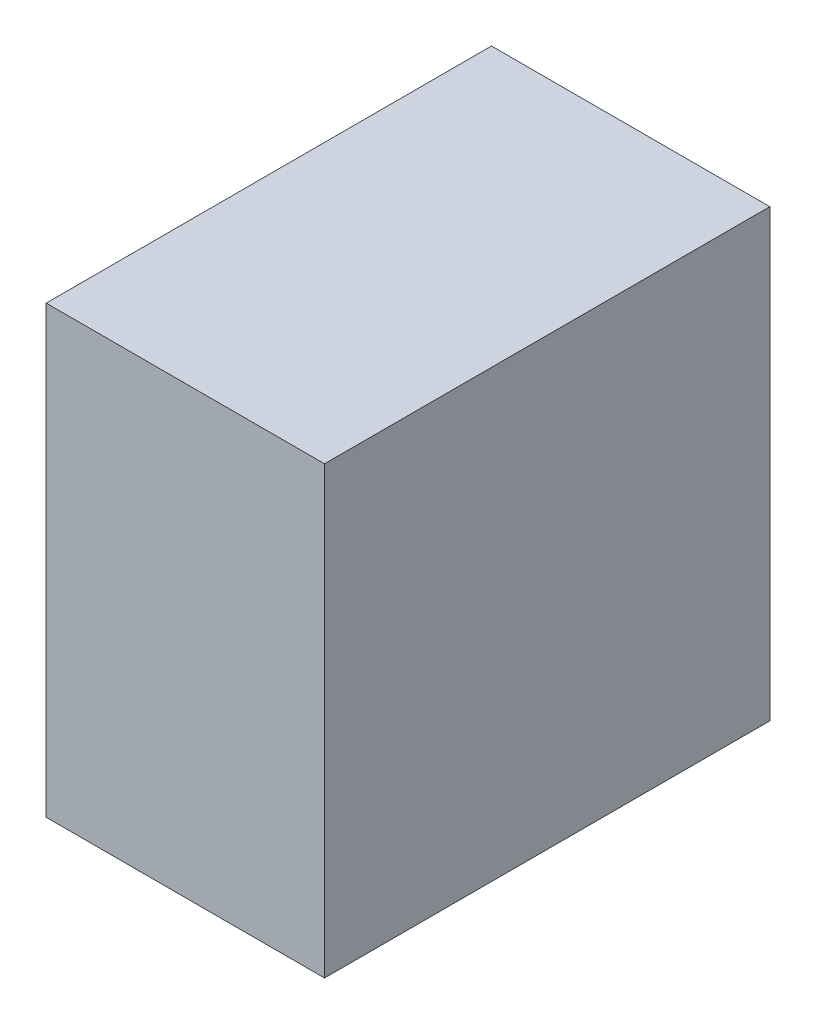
ISO-10303-21;
HEADER;
FILE_DESCRIPTION(('STEP AP214'),'2;1');
FILE_NAME('part.step','',(''),(''),'','','');
FILE_SCHEMA(('AUTOMOTIVE_DESIGN { 1 0 10303 214 1 1 1 1 }'));
ENDSEC;
DATA;
#1=APPLICATION_CONTEXT('core data for automotive mechanical design processes');
#2=APPLICATION_PROTOCOL_DEFINITION('international standard','automotive_design',2000,#1);
#3=PRODUCT_CONTEXT('',#1,'mechanical');
#4=PRODUCT('Part','Part','',(#3));
#5=PRODUCT_RELATED_PRODUCT_CATEGORY('part','',(#4));
#6=PRODUCT_DEFINITION_FORMATION('','',#4);
#7=PRODUCT_DEFINITION_CONTEXT('part definition',#1,'design');
#8=PRODUCT_DEFINITION('design','',#6,#7);
#9=PRODUCT_DEFINITION_SHAPE('','',#8);
#10=(LENGTH_UNIT() NAMED_UNIT(*) SI_UNIT(.MILLI.,.METRE.));
#11=(NAMED_UNIT(*) PLANE_ANGLE_UNIT() SI_UNIT($,.RADIAN.));
#12=(NAMED_UNIT(*) SI_UNIT($,.STERADIAN.) SOLID_ANGLE_UNIT());
#13=UNCERTAINTY_MEASURE_WITH_UNIT(LENGTH_MEASURE(1.E-05),#10,'distance_accuracy_value','');
#14=(GEOMETRIC_REPRESENTATION_CONTEXT(3) GLOBAL_UNCERTAINTY_ASSIGNED_CONTEXT((#13)) GLOBAL_UNIT_ASSIGNED_CONTEXT((#10,
#11,#12)) REPRESENTATION_CONTEXT('',''));
#15=CARTESIAN_POINT('',(0.,0.,0.));
#16=DIRECTION('',(0.,0.,1.));
#17=DIRECTION('',(1.,0.,0.));
#18=AXIS2_PLACEMENT_3D('',#15,#16,#17);
#19=CARTESIAN_POINT('',(2.5,-2.,2.));
#20=DIRECTION('',(0.,0.,-1.));
#21=DIRECTION('',(-1.,0.,0.));
#22=AXIS2_PLACEMENT_3D('',#19,#20,#21);
#23=PLANE('',#22);
#24=DIRECTION('',(0.,-1.,0.));
#25=VECTOR('',#24,1.);
#26=CARTESIAN_POINT('',(0.,-2.,2.));
#27=LINE('',#26,#25);
#28=CARTESIAN_POINT('',(0.,2.,2.));
#29=VERTEX_POINT('',#28);
#30=CARTESIAN_POINT('',(0.,-2.,2.));
#31=VERTEX_POINT('',#30);
#32=EDGE_CURVE('E143',#29,#31,#27,.T.);
#33=ORIENTED_EDGE('',*,*,#32,.T.);
#34=DIRECTION('',(-1.,0.,0.));
#35=VECTOR('',#34,1.);
#36=CARTESIAN_POINT('',(2.5,-2.,2.));
#37=LINE('',#36,#35);
#38=CARTESIAN_POINT('',(2.5,-2.,2.));
#39=VERTEX_POINT('',#38);
#40=EDGE_CURVE('E11',#39,#31,#37,.T.);
#41=ORIENTED_EDGE('',*,*,#40,.F.);
#42=DIRECTION('',(0.,-1.,0.));
#43=VECTOR('',#42,1.);
#44=CARTESIAN_POINT('',(2.5,-2.,2.));
#45=LINE('',#44,#43);
#46=CARTESIAN_POINT('',(2.5,2.,2.));
#47=VERTEX_POINT('',#46);
#48=EDGE_CURVE('E147',#47,#39,#45,.T.);
#49=ORIENTED_EDGE('',*,*,#48,.F.);
#50=DIRECTION('',(-1.,0.,0.));
#51=VECTOR('',#50,1.);
#52=CARTESIAN_POINT('',(2.5,2.,2.));
#53=LINE('',#52,#51);
#54=EDGE_CURVE('E153',#47,#29,#53,.T.);
#55=ORIENTED_EDGE('',*,*,#54,.T.);
#56=EDGE_LOOP('',(#33,#41,#49,#55));
#57=FACE_BOUND('',#56,.T.);
#58=ADVANCED_FACE('F35',(#57),#23,.F.);
#59=CARTESIAN_POINT('',(2.5,-2.,-2.));
#60=DIRECTION('',(0.,1.,0.));
#61=DIRECTION('',(0.,0.,1.));
#62=AXIS2_PLACEMENT_3D('',#59,#60,#61);
#63=PLANE('',#62);
#64=DIRECTION('',(0.,0.,-1.));
#65=VECTOR('',#64,1.);
#66=CARTESIAN_POINT('',(0.,-2.,-2.));
#67=LINE('',#66,#65);
#68=CARTESIAN_POINT('',(0.,-2.,-2.));
#69=VERTEX_POINT('',#68);
#70=EDGE_CURVE('E156',#31,#69,#67,.T.);
#71=ORIENTED_EDGE('',*,*,#70,.T.);
#72=DIRECTION('',(-1.,0.,0.));
#73=VECTOR('',#72,1.);
#74=CARTESIAN_POINT('',(2.5,-2.,-2.));
#75=LINE('',#74,#73);
#76=CARTESIAN_POINT('',(2.5,-2.,-2.));
#77=VERTEX_POINT('',#76);
#78=EDGE_CURVE('E42',#77,#69,#75,.T.);
#79=ORIENTED_EDGE('',*,*,#78,.F.);
#80=DIRECTION('',(0.,0.,-1.));
#81=VECTOR('',#80,1.);
#82=CARTESIAN_POINT('',(2.5,-2.,-2.));
#83=LINE('',#82,#81);
#84=EDGE_CURVE('E86',#39,#77,#83,.T.);
#85=ORIENTED_EDGE('',*,*,#84,.F.);
#86=ORIENTED_EDGE('',*,*,#40,.T.);
#87=EDGE_LOOP('',(#71,#79,#85,#86));
#88=FACE_BOUND('',#87,.T.);
#89=ADVANCED_FACE('F184',(#88),#63,.F.);
#90=CARTESIAN_POINT('',(2.5,-2.,-2.));
#91=DIRECTION('',(0.,0.,1.));
#92=DIRECTION('',(1.,0.,0.));
#93=AXIS2_PLACEMENT_3D('',#90,#91,#92);
#94=PLANE('',#93);
#95=DIRECTION('',(0.,1.,0.));
#96=VECTOR('',#95,1.);
#97=CARTESIAN_POINT('',(0.,-2.,-2.));
#98=LINE('',#97,#96);
#99=CARTESIAN_POINT('',(0.,2.,-2.));
#100=VERTEX_POINT('',#99);
#101=EDGE_CURVE('E158',#69,#100,#98,.T.);
#102=ORIENTED_EDGE('',*,*,#101,.T.);
#103=DIRECTION('',(-1.,0.,0.));
#104=VECTOR('',#103,1.);
#105=CARTESIAN_POINT('',(2.5,2.,-2.));
#106=LINE('',#105,#104);
#107=CARTESIAN_POINT('',(2.5,2.,-2.));
#108=VERTEX_POINT('',#107);
#109=EDGE_CURVE('E162',#108,#100,#106,.T.);
#110=ORIENTED_EDGE('',*,*,#109,.F.);
#111=DIRECTION('',(0.,1.,0.));
#112=VECTOR('',#111,1.);
#113=CARTESIAN_POINT('',(2.5,-2.,-2.));
#114=LINE('',#113,#112);
#115=EDGE_CURVE('E150',#77,#108,#114,.T.);
#116=ORIENTED_EDGE('',*,*,#115,.F.);
#117=ORIENTED_EDGE('',*,*,#78,.T.);
#118=EDGE_LOOP('',(#102,#110,#116,#117));
#119=FACE_BOUND('',#118,.T.);
#120=ADVANCED_FACE('F167',(#119),#94,.F.);
#121=CARTESIAN_POINT('',(2.5,2.,-2.));
#122=DIRECTION('',(0.,-1.,0.));
#123=DIRECTION('',(0.,0.,-1.));
#124=AXIS2_PLACEMENT_3D('',#121,#122,#123);
#125=PLANE('',#124);
#126=DIRECTION('',(0.,0.,1.));
#127=VECTOR('',#126,1.);
#128=CARTESIAN_POINT('',(0.,2.,-2.));
#129=LINE('',#128,#127);
#130=EDGE_CURVE('E79',#100,#29,#129,.T.);
#131=ORIENTED_EDGE('',*,*,#130,.T.);
#132=ORIENTED_EDGE('',*,*,#54,.F.);
#133=DIRECTION('',(0.,0.,1.));
#134=VECTOR('',#133,1.);
#135=CARTESIAN_POINT('',(2.5,2.,-2.));
#136=LINE('',#135,#134);
#137=EDGE_CURVE('E58',#108,#47,#136,.T.);
#138=ORIENTED_EDGE('',*,*,#137,.F.);
#139=ORIENTED_EDGE('',*,*,#109,.T.);
#140=EDGE_LOOP('',(#131,#132,#138,#139));
#141=FACE_BOUND('',#140,.T.);
#142=ADVANCED_FACE('F175',(#141),#125,.F.);
#143=CARTESIAN_POINT('',(2.5,0.,0.));
#144=DIRECTION('',(1.,0.,0.));
#145=DIRECTION('',(0.,0.,-1.));
#146=AXIS2_PLACEMENT_3D('',#143,#144,#145);
#147=PLANE('',#146);
#148=ORIENTED_EDGE('',*,*,#48,.T.);
#149=ORIENTED_EDGE('',*,*,#84,.T.);
#150=ORIENTED_EDGE('',*,*,#115,.T.);
#151=ORIENTED_EDGE('',*,*,#137,.T.);
#152=EDGE_LOOP('',(#148,#149,#150,#151));
#153=FACE_BOUND('',#152,.T.);
#154=ADVANCED_FACE('F177',(#153),#147,.T.);
#155=CARTESIAN_POINT('',(0.,0.,0.));
#156=DIRECTION('',(1.,0.,0.));
#157=DIRECTION('',(0.,0.,-1.));
#158=AXIS2_PLACEMENT_3D('',#155,#156,#157);
#159=PLANE('',#158);
#160=DIRECTION('',(0.,0.,-1.));
#161=VECTOR('',#160,1.);
#162=CARTESIAN_POINT('',(0.,1.,-1.));
#163=LINE('',#162,#161);
#164=CARTESIAN_POINT('',(0.,1.,1.));
#165=VERTEX_POINT('',#164);
#166=CARTESIAN_POINT('',(0.,1.,-1.));
#167=VERTEX_POINT('',#166);
#168=EDGE_CURVE('E137',#165,#167,#163,.T.);
#169=ORIENTED_EDGE('',*,*,#168,.F.);
#170=DIRECTION('',(0.,1.,0.));
#171=VECTOR('',#170,1.);
#172=CARTESIAN_POINT('',(0.,1.,1.));
#173=LINE('',#172,#171);
#174=CARTESIAN_POINT('',(0.,-1.,1.));
#175=VERTEX_POINT('',#174);
#176=EDGE_CURVE('E49',#175,#165,#173,.T.);
#177=ORIENTED_EDGE('',*,*,#176,.F.);
#178=DIRECTION('',(0.,0.,1.));
#179=VECTOR('',#178,1.);
#180=CARTESIAN_POINT('',(0.,-1.,-1.));
#181=LINE('',#180,#179);
#182=CARTESIAN_POINT('',(0.,-1.,-1.));
#183=VERTEX_POINT('',#182);
#184=EDGE_CURVE('E128',#183,#175,#181,.T.);
#185=ORIENTED_EDGE('',*,*,#184,.F.);
#186=DIRECTION('',(0.,-1.,0.));
#187=VECTOR('',#186,1.);
#188=CARTESIAN_POINT('',(0.,1.,-1.));
#189=LINE('',#188,#187);
#190=EDGE_CURVE('E131',#167,#183,#189,.T.);
#191=ORIENTED_EDGE('',*,*,#190,.F.);
#192=EDGE_LOOP('',(#169,#177,#185,#191));
#193=FACE_BOUND('',#192,.T.);
#194=ORIENTED_EDGE('',*,*,#32,.F.);
#195=ORIENTED_EDGE('',*,*,#130,.F.);
#196=ORIENTED_EDGE('',*,*,#101,.F.);
#197=ORIENTED_EDGE('',*,*,#70,.F.);
#198=EDGE_LOOP('',(#194,#195,#196,#197));
#199=FACE_BOUND('',#198,.T.);
#200=ADVANCED_FACE('F171',(#193,#199),#159,.F.);
#201=CARTESIAN_POINT('',(1.,1.,1.));
#202=DIRECTION('',(0.,0.,1.));
#203=DIRECTION('',(0.,-1.,0.));
#204=AXIS2_PLACEMENT_3D('',#201,#202,#203);
#205=PLANE('',#204);
#206=ORIENTED_EDGE('',*,*,#176,.T.);
#207=DIRECTION('',(-1.,0.,0.));
#208=VECTOR('',#207,1.);
#209=CARTESIAN_POINT('',(1.,1.,1.));
#210=LINE('',#209,#208);
#211=CARTESIAN_POINT('',(1.,1.,1.));
#212=VERTEX_POINT('',#211);
#213=EDGE_CURVE('E106',#212,#165,#210,.T.);
#214=ORIENTED_EDGE('',*,*,#213,.F.);
#215=DIRECTION('',(0.,1.,0.));
#216=VECTOR('',#215,1.);
#217=CARTESIAN_POINT('',(1.,1.,1.));
#218=LINE('',#217,#216);
#219=CARTESIAN_POINT('',(1.,-1.,1.));
#220=VERTEX_POINT('',#219);
#221=EDGE_CURVE('E110',#220,#212,#218,.T.);
#222=ORIENTED_EDGE('',*,*,#221,.F.);
#223=DIRECTION('',(-1.,0.,0.));
#224=VECTOR('',#223,1.);
#225=CARTESIAN_POINT('',(1.,-1.,1.));
#226=LINE('',#225,#224);
#227=EDGE_CURVE('E141',#220,#175,#226,.T.);
#228=ORIENTED_EDGE('',*,*,#227,.T.);
#229=EDGE_LOOP('',(#206,#214,#222,#228));
#230=FACE_BOUND('',#229,.T.);
#231=ADVANCED_FACE('F108',(#230),#205,.F.);
#232=CARTESIAN_POINT('',(1.,-1.,-1.));
#233=DIRECTION('',(0.,-1.,0.));
#234=DIRECTION('',(0.,0.,-1.));
#235=AXIS2_PLACEMENT_3D('',#232,#233,#234);
#236=PLANE('',#235);
#237=ORIENTED_EDGE('',*,*,#184,.T.);
#238=ORIENTED_EDGE('',*,*,#227,.F.);
#239=DIRECTION('',(0.,0.,1.));
#240=VECTOR('',#239,1.);
#241=CARTESIAN_POINT('',(1.,-1.,-1.));
#242=LINE('',#241,#240);
#243=CARTESIAN_POINT('',(1.,-1.,-1.));
#244=VERTEX_POINT('',#243);
#245=EDGE_CURVE('E116',#244,#220,#242,.T.);
#246=ORIENTED_EDGE('',*,*,#245,.F.);
#247=DIRECTION('',(-1.,0.,0.));
#248=VECTOR('',#247,1.);
#249=CARTESIAN_POINT('',(1.,-1.,-1.));
#250=LINE('',#249,#248);
#251=EDGE_CURVE('E144',#244,#183,#250,.T.);
#252=ORIENTED_EDGE('',*,*,#251,.T.);
#253=EDGE_LOOP('',(#237,#238,#246,#252));
#254=FACE_BOUND('',#253,.T.);
#255=ADVANCED_FACE('F236',(#254),#236,.F.);
#256=CARTESIAN_POINT('',(1.,1.,-1.));
#257=DIRECTION('',(0.,0.,-1.));
#258=DIRECTION('',(0.,1.,0.));
#259=AXIS2_PLACEMENT_3D('',#256,#257,#258);
#260=PLANE('',#259);
#261=ORIENTED_EDGE('',*,*,#190,.T.);
#262=ORIENTED_EDGE('',*,*,#251,.F.);
#263=DIRECTION('',(0.,-1.,0.));
#264=VECTOR('',#263,1.);
#265=CARTESIAN_POINT('',(1.,1.,-1.));
#266=LINE('',#265,#264);
#267=CARTESIAN_POINT('',(1.,1.,-1.));
#268=VERTEX_POINT('',#267);
#269=EDGE_CURVE('E124',#268,#244,#266,.T.);
#270=ORIENTED_EDGE('',*,*,#269,.F.);
#271=DIRECTION('',(-1.,0.,0.));
#272=VECTOR('',#271,1.);
#273=CARTESIAN_POINT('',(1.,1.,-1.));
#274=LINE('',#273,#272);
#275=EDGE_CURVE('E115',#268,#167,#274,.T.);
#276=ORIENTED_EDGE('',*,*,#275,.T.);
#277=EDGE_LOOP('',(#261,#262,#270,#276));
#278=FACE_BOUND('',#277,.T.);
#279=ADVANCED_FACE('F245',(#278),#260,.F.);
#280=CARTESIAN_POINT('',(1.,1.,-1.));
#281=DIRECTION('',(0.,1.,0.));
#282=DIRECTION('',(0.,0.,1.));
#283=AXIS2_PLACEMENT_3D('',#280,#281,#282);
#284=PLANE('',#283);
#285=ORIENTED_EDGE('',*,*,#168,.T.);
#286=ORIENTED_EDGE('',*,*,#275,.F.);
#287=DIRECTION('',(0.,0.,-1.));
#288=VECTOR('',#287,1.);
#289=CARTESIAN_POINT('',(1.,1.,-1.));
#290=LINE('',#289,#288);
#291=EDGE_CURVE('E119',#212,#268,#290,.T.);
#292=ORIENTED_EDGE('',*,*,#291,.F.);
#293=ORIENTED_EDGE('',*,*,#213,.T.);
#294=EDGE_LOOP('',(#285,#286,#292,#293));
#295=FACE_BOUND('',#294,.T.);
#296=ADVANCED_FACE('F120',(#295),#284,.F.);
#297=CARTESIAN_POINT('',(1.,0.,0.));
#298=DIRECTION('',(-1.,0.,0.));
#299=DIRECTION('',(0.,0.,1.));
#300=AXIS2_PLACEMENT_3D('',#297,#298,#299);
#301=PLANE('',#300);
#302=ORIENTED_EDGE('',*,*,#221,.T.);
#303=ORIENTED_EDGE('',*,*,#291,.T.);
#304=ORIENTED_EDGE('',*,*,#269,.T.);
#305=ORIENTED_EDGE('',*,*,#245,.T.);
#306=EDGE_LOOP('',(#302,#303,#304,#305));
#307=FACE_BOUND('',#306,.T.);
#308=ADVANCED_FACE('F126',(#307),#301,.T.);
#309=CLOSED_SHELL('',(#58,#89,#120,#142,#154,#200,#231,#255,#279,#296,#308));
#310=MANIFOLD_SOLID_BREP('B2',#309);
#311=ADVANCED_BREP_SHAPE_REPRESENTATION('',(#18,#310),#14);
#312=SHAPE_DEFINITION_REPRESENTATION(#9,#311);
ENDSEC;
END-ISO-10303-21;
